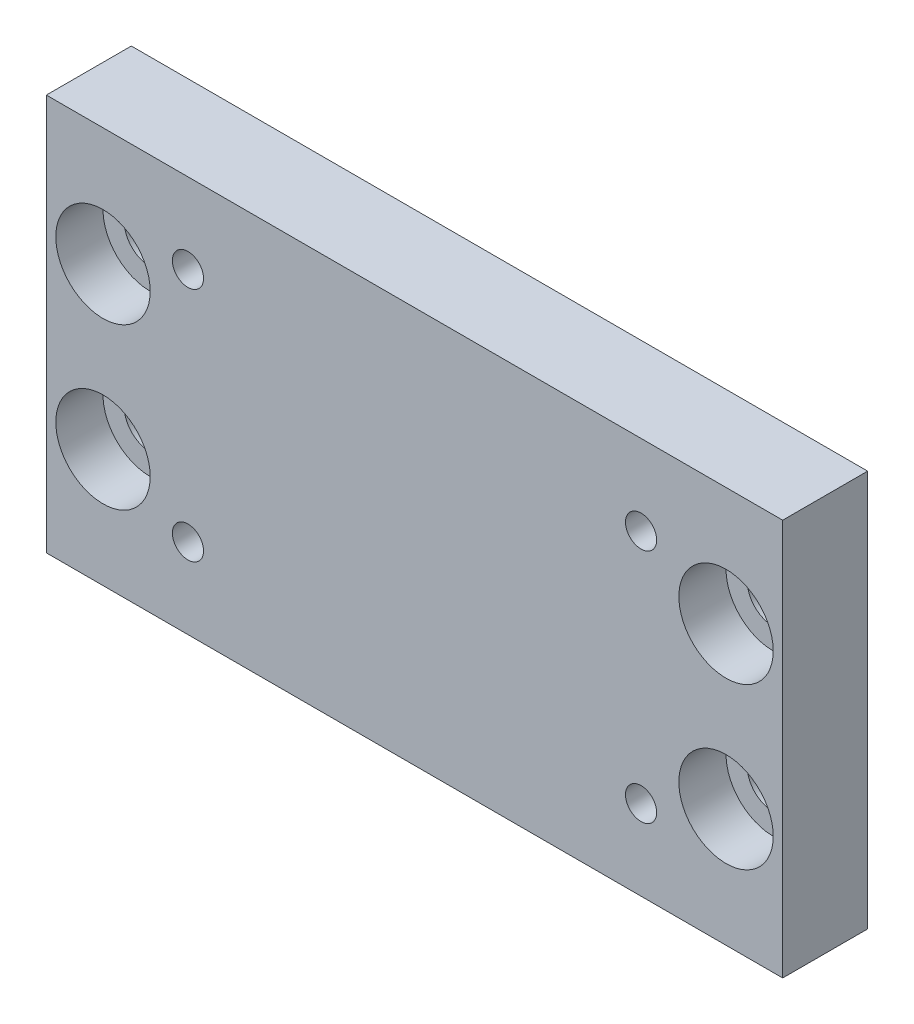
from build123d import *

# Parameters (mm, degrees)
ESQUISSE1_W                                        = 78
ESQUISSE1_H                                        = 42
EXTRUSION1_DEPTH                                   = 9
TROU_TARAUD_M4X0_71_D                              = 3.3
TROU_TARAUD_M4X0_71_DEPTH                          = 11.5
TROU_TARAUD_M4X0_71_TIP                            = 0.991420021
CHAMBRAGE_POUR_VIS_T_TE_HEXAGONALE_M51_D           = 5.5
CHAMBRAGE_POUR_VIS_T_TE_HEXAGONALE_M51_CBORE_D     = 10
CHAMBRAGE_POUR_VIS_T_TE_HEXAGONALE_M51_CBORE_DEPTH = 5


with BuildPart() as part:
    # Esquisse1 → Extrusion1 (new body)
    with BuildSketch(Plane.XY):
        Rectangle(ESQUISSE1_W, ESQUISSE1_H)
    extrude(amount=EXTRUSION1_DEPTH)

    # Trou taraud_ M4x0.71
    with Locations(Plane.XY.offset(9)):
        with Locations((-24, 12.5), (24, 12.5), (24, -12.5), (-24, -12.5)):
            Hole(TROU_TARAUD_M4X0_71_D / 2, depth=TROU_TARAUD_M4X0_71_DEPTH)
            with Locations((0, 0, -(TROU_TARAUD_M4X0_71_DEPTH + TROU_TARAUD_M4X0_71_TIP / 2))):  # 118° drill point
                Cone(0, TROU_TARAUD_M4X0_71_D / 2, TROU_TARAUD_M4X0_71_TIP, mode=Mode.SUBTRACT)

    # Chambrage pour vis _ t_te hexagonale M51 (through all)
    with Locations(Plane.XY.offset(9)):
        with Locations((-33, 8.5), (-33, -8.5), (33, -8.5), (33, 8.5)):
            CounterBoreHole(CHAMBRAGE_POUR_VIS_T_TE_HEXAGONALE_M51_D / 2, CHAMBRAGE_POUR_VIS_T_TE_HEXAGONALE_M51_CBORE_D / 2, CHAMBRAGE_POUR_VIS_T_TE_HEXAGONALE_M51_CBORE_DEPTH)


solid = part.part
